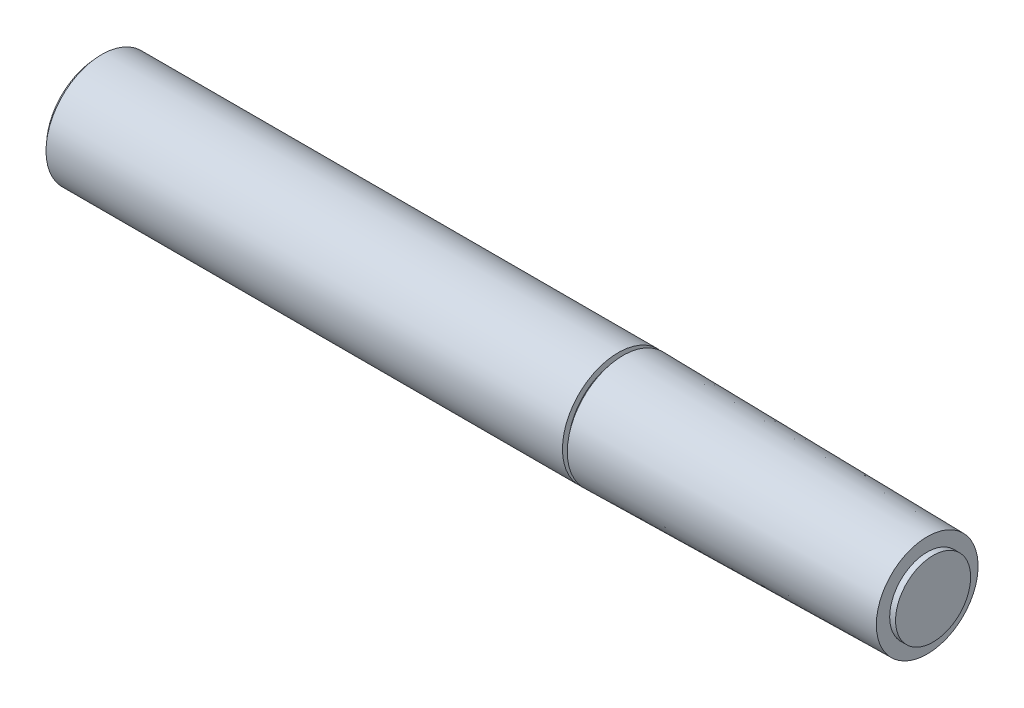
from build123d import *


with BuildPart() as part:
    # Esquisse1 → R_volution1 (revolve)
    with BuildSketch(Plane.XY, mode=Mode.PRIVATE) as r_volution1_sk:
        Polygon((26, 0), (26, 3.1), (25.516476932, 3.1), (25.516476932, 4.2), (0.401287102, 4.600804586), (0.401287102, 4.106934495), (0, 4.106934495), (0, 4.600804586), (-42.639918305, 4.600804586), (-42.639918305, 4.2), (-43, 4.2), (-43, 0), align=None)
    revolve(r_volution1_sk.sketch.rotate(Axis((-50.439947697, 0, 0), (1, 0, 0)), 90), axis=Axis((-50.439947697, 0, 0), (1, 0, 0)))


solid = part.part
